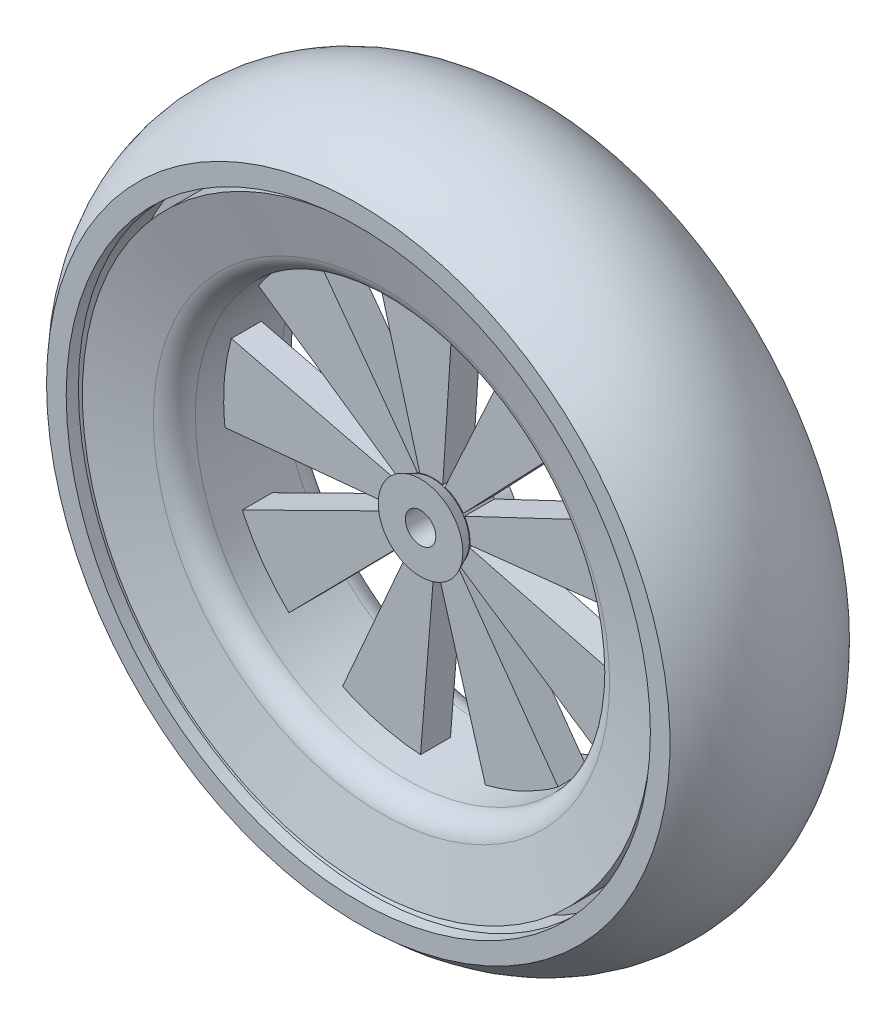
from build123d import *

# Parameters (mm, degrees)
SKETCH1_R           = 30
BOSS_EXTRUDE1_DEPTH = 25
SKETCH2_R           = 30
BOSS_EXTRUDE2_DEPTH = 10
BOSS_EXTRUDE2_DRAFT = -25
SKETCH3_R           = 30
BOSS_EXTRUDE3_DEPTH = 10
BOSS_EXTRUDE3_DRAFT = -25
SKETCH4_R           = 12.5
CUT_EXTRUDE1_DEPTH  = 60
BOSS_EXTRUDE7_DEPTH = 24.5
CIRPATTERN6_COUNT   = 9
FILLET2_R           = 20
SCALE3_SCALE        = 0.9


with BuildPart() as part:
    # Sketch1 → Boss-Extrude1 (new body)
    with BuildSketch(Plane.XY):
        Circle(SKETCH1_R)
    extrude(amount=BOSS_EXTRUDE1_DEPTH)


with BuildPart() as boss_extrude2_tool:
    # Sketch2 → Boss-Extrude2 (with draft: the straight prism first)
    with BuildSketch(Plane.XY.offset(25)):
        Circle(SKETCH2_R)
    extrude(amount=BOSS_EXTRUDE2_DEPTH)
    # Boss-Extrude2: the draft: its side faces are tilted about the plane it starts from
    boss_extrude2_sides = [boss_extrude2_tool.faces().sort_by_distance(p)[0] for p in [
        (-30, 0, 30),
    ]]
    draft(boss_extrude2_sides, Plane.XY.offset(25), BOSS_EXTRUDE2_DRAFT)


with BuildPart() as part_1:
    add(part.part)

    # Boss-Extrude2: add boss_extrude2_tool
    add(boss_extrude2_tool.part)


with BuildPart() as boss_extrude3_tool:
    # Sketch3 → Boss-Extrude3 (with draft: the straight prism first)
    with BuildSketch(Plane(origin=(0, 0, 0), x_dir=(-1, 0, 0), z_dir=(0, 0, -1))):
        Circle(SKETCH3_R)
    extrude(amount=BOSS_EXTRUDE3_DEPTH)
    # Boss-Extrude3: the draft: its side faces are tilted about the plane it starts from
    boss_extrude3_sides = [boss_extrude3_tool.faces().sort_by_distance(p)[0] for p in [
        (30, 0, -5),
    ]]
    draft(boss_extrude3_sides, Plane(origin=(0, 0, 0), x_dir=(-1, 0, 0), z_dir=(0, 0, -1)), BOSS_EXTRUDE3_DRAFT)


with BuildPart() as part_2:
    add(part_1.part)

    # Boss-Extrude3: add boss_extrude3_tool
    add(boss_extrude3_tool.part)

    # Sketch4 → Cut-Extrude1 (cut)
    with BuildSketch(Plane.XY.offset(35)):
        Circle(SKETCH4_R)
    extrude(amount=-CUT_EXTRUDE1_DEPTH, mode=Mode.SUBTRACT)

    # Sketch6 → Boss-Extrude7 (add)
    with BuildSketch(Plane.XY):
        Polygon((0, 34.663076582), (-3.601418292, 34.475479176), (-6.06882283, 34.127675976), (-10.742792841, 32.956354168), (-12.289223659, 32.411477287), (-11.042769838, 27.893677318), (-8.881882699, 28.655054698), (-7.06796088, 29.155512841), (-6.06882283, 29.379744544), (-3.601418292, 29.783045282), (-1.502533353, 29.9623496), (0, 30), (1.790893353, 29.946497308), (3.598773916, 29.783364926), (6.241564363, 29.343532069), (7.294721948, 29.099605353), (7.726789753, 29.099605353), (8.025395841, 33.72123811), (4.460577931, 34.374876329), align=None)
        Polygon((-10.742792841, 32.956354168), (-6.06882283, 34.127675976), (-3.601418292, 34.475479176), (0, 34.663076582), (4.460577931, 34.374876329), (8.025395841, 33.72123811), (16.899954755, 171.075946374), (12.462675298, 171.456319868), (0, 171.908661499), (-10.742792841, 171.572667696), (-17.506782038, 171.014913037), (-34.663076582, 168.377727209), (-42.602840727, 166.546047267), (-48.823241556, 164.829848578), (-12.289223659, 32.411477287), align=None)
    boss_extrude7 = extrude(amount=BOSS_EXTRUDE7_DEPTH)

    # CirPattern6: Boss-Extrude7 ×9 about axis
    cirpattern6_axis = Axis((0, 0, 0), (0, 0, 1))
    for i in range(1, CIRPATTERN6_COUNT):
        add(boss_extrude7.rotate(cirpattern6_axis, i * 360 / CIRPATTERN6_COUNT))


with BuildPart() as body_2:
    # Sketch5 → Revolve-Thin3 (revolve)
    with BuildSketch(Plane(origin=(0, 0, 0), x_dir=(0, 0, -1), z_dir=(1, 0, 0)), mode=Mode.PRIVATE) as revolve_thin3_sk:
        Polygon((61.011456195, 239.348644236), (61.011456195, 255.462170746), (1.011456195, 255.462170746), (1.011456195, 223.235117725), (41.011456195, 223.235117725), (30.395485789, 181.908661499), (-55.395485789, 181.908661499), (-66.011456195, 223.235117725), (-26.011456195, 223.235117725), (-26.011456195, 255.462170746), (-86.011456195, 255.462170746), (-86.011456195, 239.348644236), (-76.011456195, 239.348644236), (-76.011456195, 245.462170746), (-36.011456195, 245.462170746), (-36.011456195, 233.235117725), (-78.904931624, 233.235117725), (-63.151346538, 171.908661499), (38.151346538, 171.908661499), (53.904931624, 233.235117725), (11.011456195, 233.235117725), (11.011456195, 245.462170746), (51.011456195, 245.462170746), (51.011456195, 239.348644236), align=None)
    revolve(revolve_thin3_sk.sketch.rotate(Axis((0, 0, 35), (0, 0, -1)), 90), axis=Axis((0, 0, 35), (0, 0, -1)))

    # Sketch7 → Revolve4 (revolve)
    with BuildSketch(Plane(origin=(0, 0, 0), x_dir=(1, 0, 0), z_dir=(0, 1, 0)), mode=Mode.PRIVATE) as revolve4_sk:
        with BuildLine():
            Line((255.462170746, 61.011456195), (255.462170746, -86.011456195))
            ThreePointArc((255.462170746, -86.011456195), (285.911612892, -12.5), (255.462170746, 61.011456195))
        make_face()
    revolve(revolve4_sk.sketch.rotate(Axis((0, 0, -61.011456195), (0, 0, 1)), 181.67114358), axis=Axis((0, 0, -61.011456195), (0, 0, 1)))

    # Fillet2
    fillet2_edges = [body_2.edges().sort_by_distance(p)[0] for p in [
        (-171.908661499, 0, -38.151346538),
        (-171.908661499, 0, 63.151346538),
    ]]
    fillet(fillet2_edges, radius=FILLET2_R)


with BuildPart() as body_2_1:
    # Scale3: scaled about (0, 0, 0)
    add(body_2.part.scale(SCALE3_SCALE))


with BuildPart() as part_3:
    # Scale3: scaled about (0, 0, 0)
    add(part_2.part.scale(SCALE3_SCALE))


solid = Compound([body_2_1.part, part_3.part])
